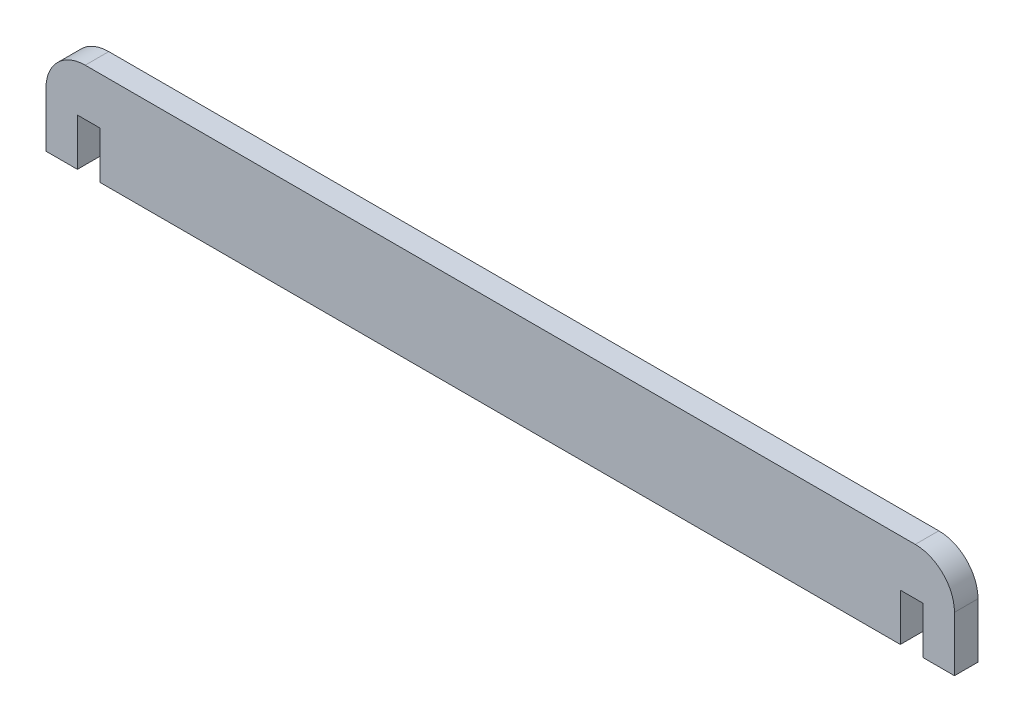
ISO-10303-21;
HEADER;
FILE_DESCRIPTION(('STEP AP214'),'2;1');
FILE_NAME('part.step','',(''),(''),'','','');
FILE_SCHEMA(('AUTOMOTIVE_DESIGN { 1 0 10303 214 1 1 1 1 }'));
ENDSEC;
DATA;
#1=APPLICATION_CONTEXT('core data for automotive mechanical design processes');
#2=APPLICATION_PROTOCOL_DEFINITION('international standard','automotive_design',2000,#1);
#3=PRODUCT_CONTEXT('',#1,'mechanical');
#4=PRODUCT('Part','Part','',(#3));
#5=PRODUCT_RELATED_PRODUCT_CATEGORY('part','',(#4));
#6=PRODUCT_DEFINITION_FORMATION('','',#4);
#7=PRODUCT_DEFINITION_CONTEXT('part definition',#1,'design');
#8=PRODUCT_DEFINITION('design','',#6,#7);
#9=PRODUCT_DEFINITION_SHAPE('','',#8);
#10=(LENGTH_UNIT() NAMED_UNIT(*) SI_UNIT(.MILLI.,.METRE.));
#11=(NAMED_UNIT(*) PLANE_ANGLE_UNIT() SI_UNIT($,.RADIAN.));
#12=(NAMED_UNIT(*) SI_UNIT($,.STERADIAN.) SOLID_ANGLE_UNIT());
#13=UNCERTAINTY_MEASURE_WITH_UNIT(LENGTH_MEASURE(1.E-05),#10,'distance_accuracy_value','');
#14=(GEOMETRIC_REPRESENTATION_CONTEXT(3) GLOBAL_UNCERTAINTY_ASSIGNED_CONTEXT((#13)) GLOBAL_UNIT_ASSIGNED_CONTEXT((#10,
#11,#12)) REPRESENTATION_CONTEXT('',''));
#15=CARTESIAN_POINT('',(0.,0.,0.));
#16=DIRECTION('',(0.,0.,1.));
#17=DIRECTION('',(1.,0.,0.));
#18=AXIS2_PLACEMENT_3D('',#15,#16,#17);
#19=CARTESIAN_POINT('',(0.,0.,3.));
#20=DIRECTION('',(1.,0.,0.));
#21=DIRECTION('',(0.,0.,-1.));
#22=AXIS2_PLACEMENT_3D('',#19,#20,#21);
#23=PLANE('',#22);
#24=DIRECTION('',(0.,-1.,0.));
#25=VECTOR('',#24,1.);
#26=CARTESIAN_POINT('',(0.,0.,0.));
#27=LINE('',#26,#25);
#28=CARTESIAN_POINT('',(0.,6.,0.));
#29=VERTEX_POINT('',#28);
#30=CARTESIAN_POINT('',(0.,0.,0.));
#31=VERTEX_POINT('',#30);
#32=EDGE_CURVE('E163',#29,#31,#27,.T.);
#33=ORIENTED_EDGE('',*,*,#32,.T.);
#34=DIRECTION('',(0.,0.,-1.));
#35=VECTOR('',#34,1.);
#36=CARTESIAN_POINT('',(0.,0.,3.));
#37=LINE('',#36,#35);
#38=CARTESIAN_POINT('',(0.,0.,3.));
#39=VERTEX_POINT('',#38);
#40=EDGE_CURVE('E145',#39,#31,#37,.T.);
#41=ORIENTED_EDGE('',*,*,#40,.F.);
#42=DIRECTION('',(0.,-1.,0.));
#43=VECTOR('',#42,1.);
#44=CARTESIAN_POINT('',(0.,0.,3.));
#45=LINE('',#44,#43);
#46=CARTESIAN_POINT('',(0.,6.,3.));
#47=VERTEX_POINT('',#46);
#48=EDGE_CURVE('E151',#47,#39,#45,.T.);
#49=ORIENTED_EDGE('',*,*,#48,.F.);
#50=DIRECTION('',(0.,0.,-1.));
#51=VECTOR('',#50,1.);
#52=CARTESIAN_POINT('',(0.,6.,3.));
#53=LINE('',#52,#51);
#54=EDGE_CURVE('E217',#47,#29,#53,.T.);
#55=ORIENTED_EDGE('',*,*,#54,.T.);
#56=EDGE_LOOP('',(#33,#41,#49,#55));
#57=FACE_BOUND('',#56,.T.);
#58=ADVANCED_FACE('F37',(#57),#23,.F.);
#59=CARTESIAN_POINT('',(0.,0.,3.));
#60=DIRECTION('',(0.,1.,0.));
#61=DIRECTION('',(0.,0.,1.));
#62=AXIS2_PLACEMENT_3D('',#59,#60,#61);
#63=PLANE('',#62);
#64=DIRECTION('',(1.,0.,0.));
#65=VECTOR('',#64,1.);
#66=CARTESIAN_POINT('',(0.,0.,0.));
#67=LINE('',#66,#65);
#68=CARTESIAN_POINT('',(102.,0.,0.));
#69=VERTEX_POINT('',#68);
#70=EDGE_CURVE('E248',#31,#69,#67,.T.);
#71=ORIENTED_EDGE('',*,*,#70,.T.);
#72=DIRECTION('',(0.,0.,-1.));
#73=VECTOR('',#72,1.);
#74=CARTESIAN_POINT('',(102.,0.,3.));
#75=LINE('',#74,#73);
#76=CARTESIAN_POINT('',(102.,0.,3.));
#77=VERTEX_POINT('',#76);
#78=EDGE_CURVE('E148',#77,#69,#75,.T.);
#79=ORIENTED_EDGE('',*,*,#78,.F.);
#80=DIRECTION('',(1.,0.,0.));
#81=VECTOR('',#80,1.);
#82=CARTESIAN_POINT('',(0.,0.,3.));
#83=LINE('',#82,#81);
#84=EDGE_CURVE('E141',#39,#77,#83,.T.);
#85=ORIENTED_EDGE('',*,*,#84,.F.);
#86=ORIENTED_EDGE('',*,*,#40,.T.);
#87=EDGE_LOOP('',(#71,#79,#85,#86));
#88=FACE_BOUND('',#87,.T.);
#89=ADVANCED_FACE('F143',(#88),#63,.F.);
#90=CARTESIAN_POINT('',(102.,0.,3.));
#91=DIRECTION('',(-1.,0.,0.));
#92=DIRECTION('',(0.,0.,1.));
#93=AXIS2_PLACEMENT_3D('',#90,#91,#92);
#94=PLANE('',#93);
#95=DIRECTION('',(0.,1.,0.));
#96=VECTOR('',#95,1.);
#97=CARTESIAN_POINT('',(102.,0.,0.));
#98=LINE('',#97,#96);
#99=CARTESIAN_POINT('',(102.,6.,0.));
#100=VERTEX_POINT('',#99);
#101=EDGE_CURVE('E246',#69,#100,#98,.T.);
#102=ORIENTED_EDGE('',*,*,#101,.T.);
#103=DIRECTION('',(0.,0.,-1.));
#104=VECTOR('',#103,1.);
#105=CARTESIAN_POINT('',(102.,6.,3.));
#106=LINE('',#105,#104);
#107=CARTESIAN_POINT('',(102.,6.,3.));
#108=VERTEX_POINT('',#107);
#109=EDGE_CURVE('E168',#108,#100,#106,.T.);
#110=ORIENTED_EDGE('',*,*,#109,.F.);
#111=DIRECTION('',(0.,1.,0.));
#112=VECTOR('',#111,1.);
#113=CARTESIAN_POINT('',(102.,0.,3.));
#114=LINE('',#113,#112);
#115=EDGE_CURVE('E150',#77,#108,#114,.T.);
#116=ORIENTED_EDGE('',*,*,#115,.F.);
#117=ORIENTED_EDGE('',*,*,#78,.T.);
#118=EDGE_LOOP('',(#102,#110,#116,#117));
#119=FACE_BOUND('',#118,.T.);
#120=ADVANCED_FACE('F265',(#119),#94,.F.);
#121=CARTESIAN_POINT('',(102.,6.,3.));
#122=DIRECTION('',(0.,1.,0.));
#123=DIRECTION('',(0.,0.,1.));
#124=AXIS2_PLACEMENT_3D('',#121,#122,#123);
#125=PLANE('',#124);
#126=DIRECTION('',(1.,0.,0.));
#127=VECTOR('',#126,1.);
#128=CARTESIAN_POINT('',(102.,6.,0.));
#129=LINE('',#128,#127);
#130=CARTESIAN_POINT('',(104.9,6.,0.));
#131=VERTEX_POINT('',#130);
#132=EDGE_CURVE('E241',#100,#131,#129,.T.);
#133=ORIENTED_EDGE('',*,*,#132,.T.);
#134=DIRECTION('',(0.,0.,-1.));
#135=VECTOR('',#134,1.);
#136=CARTESIAN_POINT('',(104.9,6.,3.));
#137=LINE('',#136,#135);
#138=CARTESIAN_POINT('',(104.9,6.,3.));
#139=VERTEX_POINT('',#138);
#140=EDGE_CURVE('E232',#139,#131,#137,.T.);
#141=ORIENTED_EDGE('',*,*,#140,.F.);
#142=DIRECTION('',(1.,0.,0.));
#143=VECTOR('',#142,1.);
#144=CARTESIAN_POINT('',(102.,6.,3.));
#145=LINE('',#144,#143);
#146=EDGE_CURVE('E242',#108,#139,#145,.T.);
#147=ORIENTED_EDGE('',*,*,#146,.F.);
#148=ORIENTED_EDGE('',*,*,#109,.T.);
#149=EDGE_LOOP('',(#133,#141,#147,#148));
#150=FACE_BOUND('',#149,.T.);
#151=ADVANCED_FACE('F239',(#150),#125,.F.);
#152=CARTESIAN_POINT('',(104.9,6.,3.));
#153=DIRECTION('',(1.,0.,0.));
#154=DIRECTION('',(0.,0.,-1.));
#155=AXIS2_PLACEMENT_3D('',#152,#153,#154);
#156=PLANE('',#155);
#157=DIRECTION('',(0.,-1.,0.));
#158=VECTOR('',#157,1.);
#159=CARTESIAN_POINT('',(104.9,6.,0.));
#160=LINE('',#159,#158);
#161=CARTESIAN_POINT('',(104.9,0.,0.));
#162=VERTEX_POINT('',#161);
#163=EDGE_CURVE('E207',#131,#162,#160,.T.);
#164=ORIENTED_EDGE('',*,*,#163,.T.);
#165=DIRECTION('',(0.,0.,-1.));
#166=VECTOR('',#165,1.);
#167=CARTESIAN_POINT('',(104.9,0.,3.));
#168=LINE('',#167,#166);
#169=CARTESIAN_POINT('',(104.9,0.,3.));
#170=VERTEX_POINT('',#169);
#171=EDGE_CURVE('E229',#170,#162,#168,.T.);
#172=ORIENTED_EDGE('',*,*,#171,.F.);
#173=DIRECTION('',(0.,-1.,0.));
#174=VECTOR('',#173,1.);
#175=CARTESIAN_POINT('',(104.9,6.,3.));
#176=LINE('',#175,#174);
#177=EDGE_CURVE('E262',#139,#170,#176,.T.);
#178=ORIENTED_EDGE('',*,*,#177,.F.);
#179=ORIENTED_EDGE('',*,*,#140,.T.);
#180=EDGE_LOOP('',(#164,#172,#178,#179));
#181=FACE_BOUND('',#180,.T.);
#182=ADVANCED_FACE('F272',(#181),#156,.F.);
#183=CARTESIAN_POINT('',(104.9,0.,3.));
#184=DIRECTION('',(0.,1.,0.));
#185=DIRECTION('',(0.,0.,1.));
#186=AXIS2_PLACEMENT_3D('',#183,#184,#185);
#187=PLANE('',#186);
#188=DIRECTION('',(1.,0.,0.));
#189=VECTOR('',#188,1.);
#190=CARTESIAN_POINT('',(104.9,0.,0.));
#191=LINE('',#190,#189);
#192=CARTESIAN_POINT('',(108.9,0.,0.));
#193=VERTEX_POINT('',#192);
#194=EDGE_CURVE('E203',#162,#193,#191,.T.);
#195=ORIENTED_EDGE('',*,*,#194,.T.);
#196=DIRECTION('',(0.,0.,-1.));
#197=VECTOR('',#196,1.);
#198=CARTESIAN_POINT('',(108.9,0.,3.));
#199=LINE('',#198,#197);
#200=CARTESIAN_POINT('',(108.9,0.,3.));
#201=VERTEX_POINT('',#200);
#202=EDGE_CURVE('E202',#201,#193,#199,.T.);
#203=ORIENTED_EDGE('',*,*,#202,.F.);
#204=DIRECTION('',(1.,0.,0.));
#205=VECTOR('',#204,1.);
#206=CARTESIAN_POINT('',(104.9,0.,3.));
#207=LINE('',#206,#205);
#208=EDGE_CURVE('E260',#170,#201,#207,.T.);
#209=ORIENTED_EDGE('',*,*,#208,.F.);
#210=ORIENTED_EDGE('',*,*,#171,.T.);
#211=EDGE_LOOP('',(#195,#203,#209,#210));
#212=FACE_BOUND('',#211,.T.);
#213=ADVANCED_FACE('F311',(#212),#187,.F.);
#214=CARTESIAN_POINT('',(108.9,0.,3.));
#215=DIRECTION('',(-1.,0.,0.));
#216=DIRECTION('',(0.,0.,1.));
#217=AXIS2_PLACEMENT_3D('',#214,#215,#216);
#218=PLANE('',#217);
#219=DIRECTION('',(0.,1.,0.));
#220=VECTOR('',#219,1.);
#221=CARTESIAN_POINT('',(108.9,0.,0.));
#222=LINE('',#221,#220);
#223=CARTESIAN_POINT('',(108.9,7.,0.));
#224=VERTEX_POINT('',#223);
#225=EDGE_CURVE('E197',#193,#224,#222,.T.);
#226=ORIENTED_EDGE('',*,*,#225,.T.);
#227=DIRECTION('',(0.,0.,-1.));
#228=VECTOR('',#227,1.);
#229=CARTESIAN_POINT('',(108.9,7.,3.));
#230=LINE('',#229,#228);
#231=CARTESIAN_POINT('',(108.9,7.,3.));
#232=VERTEX_POINT('',#231);
#233=EDGE_CURVE('E60',#224,#232,#230,.F.);
#234=ORIENTED_EDGE('',*,*,#233,.T.);
#235=DIRECTION('',(0.,1.,0.));
#236=VECTOR('',#235,1.);
#237=CARTESIAN_POINT('',(108.9,0.,3.));
#238=LINE('',#237,#236);
#239=EDGE_CURVE('E182',#201,#232,#238,.T.);
#240=ORIENTED_EDGE('',*,*,#239,.F.);
#241=ORIENTED_EDGE('',*,*,#202,.T.);
#242=EDGE_LOOP('',(#226,#234,#240,#241));
#243=FACE_BOUND('',#242,.T.);
#244=ADVANCED_FACE('F200',(#243),#218,.F.);
#245=CARTESIAN_POINT('',(-6.9,12.,3.));
#246=DIRECTION('',(0.,-1.,0.));
#247=DIRECTION('',(0.,0.,-1.));
#248=AXIS2_PLACEMENT_3D('',#245,#246,#247);
#249=PLANE('',#248);
#250=DIRECTION('',(-1.,0.,0.));
#251=VECTOR('',#250,1.);
#252=CARTESIAN_POINT('',(-6.9,12.,3.));
#253=LINE('',#252,#251);
#254=CARTESIAN_POINT('',(103.9,12.,3.));
#255=VERTEX_POINT('',#254);
#256=CARTESIAN_POINT('',(-1.9,12.,3.));
#257=VERTEX_POINT('',#256);
#258=EDGE_CURVE('E181',#255,#257,#253,.T.);
#259=ORIENTED_EDGE('',*,*,#258,.F.);
#260=DIRECTION('',(0.,0.,-1.));
#261=VECTOR('',#260,1.);
#262=CARTESIAN_POINT('',(103.9,12.,3.));
#263=LINE('',#262,#261);
#264=CARTESIAN_POINT('',(103.9,12.,0.));
#265=VERTEX_POINT('',#264);
#266=EDGE_CURVE('E166',#255,#265,#263,.T.);
#267=ORIENTED_EDGE('',*,*,#266,.T.);
#268=DIRECTION('',(-1.,0.,0.));
#269=VECTOR('',#268,1.);
#270=CARTESIAN_POINT('',(-6.9,12.,0.));
#271=LINE('',#270,#269);
#272=CARTESIAN_POINT('',(-1.9,12.,0.));
#273=VERTEX_POINT('',#272);
#274=EDGE_CURVE('E198',#265,#273,#271,.T.);
#275=ORIENTED_EDGE('',*,*,#274,.T.);
#276=DIRECTION('',(0.,0.,-1.));
#277=VECTOR('',#276,1.);
#278=CARTESIAN_POINT('',(-1.9,12.,3.));
#279=LINE('',#278,#277);
#280=EDGE_CURVE('E164',#273,#257,#279,.F.);
#281=ORIENTED_EDGE('',*,*,#280,.T.);
#282=EDGE_LOOP('',(#259,#267,#275,#281));
#283=FACE_BOUND('',#282,.T.);
#284=ADVANCED_FACE('F186',(#283),#249,.F.);
#285=CARTESIAN_POINT('',(-6.9,0.,3.));
#286=DIRECTION('',(1.,0.,0.));
#287=DIRECTION('',(0.,0.,-1.));
#288=AXIS2_PLACEMENT_3D('',#285,#286,#287);
#289=PLANE('',#288);
#290=DIRECTION('',(0.,-1.,0.));
#291=VECTOR('',#290,1.);
#292=CARTESIAN_POINT('',(-6.9,0.,3.));
#293=LINE('',#292,#291);
#294=CARTESIAN_POINT('',(-6.9,7.,3.));
#295=VERTEX_POINT('',#294);
#296=CARTESIAN_POINT('',(-6.9,0.,3.));
#297=VERTEX_POINT('',#296);
#298=EDGE_CURVE('E190',#295,#297,#293,.T.);
#299=ORIENTED_EDGE('',*,*,#298,.F.);
#300=DIRECTION('',(0.,0.,-1.));
#301=VECTOR('',#300,1.);
#302=CARTESIAN_POINT('',(-6.9,7.,3.));
#303=LINE('',#302,#301);
#304=CARTESIAN_POINT('',(-6.9,7.,0.));
#305=VERTEX_POINT('',#304);
#306=EDGE_CURVE('E11',#295,#305,#303,.T.);
#307=ORIENTED_EDGE('',*,*,#306,.T.);
#308=DIRECTION('',(0.,-1.,0.));
#309=VECTOR('',#308,1.);
#310=CARTESIAN_POINT('',(-6.9,0.,0.));
#311=LINE('',#310,#309);
#312=CARTESIAN_POINT('',(-6.9,0.,0.));
#313=VERTEX_POINT('',#312);
#314=EDGE_CURVE('E205',#305,#313,#311,.T.);
#315=ORIENTED_EDGE('',*,*,#314,.T.);
#316=DIRECTION('',(0.,0.,-1.));
#317=VECTOR('',#316,1.);
#318=CARTESIAN_POINT('',(-6.9,0.,3.));
#319=LINE('',#318,#317);
#320=EDGE_CURVE('E225',#297,#313,#319,.T.);
#321=ORIENTED_EDGE('',*,*,#320,.F.);
#322=EDGE_LOOP('',(#299,#307,#315,#321));
#323=FACE_BOUND('',#322,.T.);
#324=ADVANCED_FACE('F302',(#323),#289,.F.);
#325=CARTESIAN_POINT('',(-2.9,0.,3.));
#326=DIRECTION('',(0.,1.,0.));
#327=DIRECTION('',(-1.,0.,0.));
#328=AXIS2_PLACEMENT_3D('',#325,#326,#327);
#329=PLANE('',#328);
#330=DIRECTION('',(1.,0.,0.));
#331=VECTOR('',#330,1.);
#332=CARTESIAN_POINT('',(-2.9,0.,0.));
#333=LINE('',#332,#331);
#334=CARTESIAN_POINT('',(-2.9,0.,0.));
#335=VERTEX_POINT('',#334);
#336=EDGE_CURVE('E212',#313,#335,#333,.T.);
#337=ORIENTED_EDGE('',*,*,#336,.T.);
#338=DIRECTION('',(0.,0.,-1.));
#339=VECTOR('',#338,1.);
#340=CARTESIAN_POINT('',(-2.9,0.,3.));
#341=LINE('',#340,#339);
#342=CARTESIAN_POINT('',(-2.9,0.,3.));
#343=VERTEX_POINT('',#342);
#344=EDGE_CURVE('E222',#343,#335,#341,.T.);
#345=ORIENTED_EDGE('',*,*,#344,.F.);
#346=DIRECTION('',(1.,0.,0.));
#347=VECTOR('',#346,1.);
#348=CARTESIAN_POINT('',(-2.9,0.,3.));
#349=LINE('',#348,#347);
#350=EDGE_CURVE('E256',#297,#343,#349,.T.);
#351=ORIENTED_EDGE('',*,*,#350,.F.);
#352=ORIENTED_EDGE('',*,*,#320,.T.);
#353=EDGE_LOOP('',(#337,#345,#351,#352));
#354=FACE_BOUND('',#353,.T.);
#355=ADVANCED_FACE('F298',(#354),#329,.F.);
#356=CARTESIAN_POINT('',(-2.9,6.,3.));
#357=DIRECTION('',(-1.,0.,0.));
#358=DIRECTION('',(0.,0.,1.));
#359=AXIS2_PLACEMENT_3D('',#356,#357,#358);
#360=PLANE('',#359);
#361=DIRECTION('',(0.,1.,0.));
#362=VECTOR('',#361,1.);
#363=CARTESIAN_POINT('',(-2.9,6.,0.));
#364=LINE('',#363,#362);
#365=CARTESIAN_POINT('',(-2.9,6.,0.));
#366=VERTEX_POINT('',#365);
#367=EDGE_CURVE('E214',#335,#366,#364,.T.);
#368=ORIENTED_EDGE('',*,*,#367,.T.);
#369=DIRECTION('',(0.,0.,-1.));
#370=VECTOR('',#369,1.);
#371=CARTESIAN_POINT('',(-2.9,6.,3.));
#372=LINE('',#371,#370);
#373=CARTESIAN_POINT('',(-2.9,6.,3.));
#374=VERTEX_POINT('',#373);
#375=EDGE_CURVE('E219',#374,#366,#372,.T.);
#376=ORIENTED_EDGE('',*,*,#375,.F.);
#377=DIRECTION('',(0.,1.,0.));
#378=VECTOR('',#377,1.);
#379=CARTESIAN_POINT('',(-2.9,6.,3.));
#380=LINE('',#379,#378);
#381=EDGE_CURVE('E254',#343,#374,#380,.T.);
#382=ORIENTED_EDGE('',*,*,#381,.F.);
#383=ORIENTED_EDGE('',*,*,#344,.T.);
#384=EDGE_LOOP('',(#368,#376,#382,#383));
#385=FACE_BOUND('',#384,.T.);
#386=ADVANCED_FACE('F294',(#385),#360,.F.);
#387=CARTESIAN_POINT('',(0.,6.,3.));
#388=DIRECTION('',(0.,1.,0.));
#389=DIRECTION('',(0.,0.,1.));
#390=AXIS2_PLACEMENT_3D('',#387,#388,#389);
#391=PLANE('',#390);
#392=DIRECTION('',(1.,0.,0.));
#393=VECTOR('',#392,1.);
#394=CARTESIAN_POINT('',(0.,6.,0.));
#395=LINE('',#394,#393);
#396=EDGE_CURVE('E160',#366,#29,#395,.T.);
#397=ORIENTED_EDGE('',*,*,#396,.T.);
#398=ORIENTED_EDGE('',*,*,#54,.F.);
#399=DIRECTION('',(1.,0.,0.));
#400=VECTOR('',#399,1.);
#401=CARTESIAN_POINT('',(0.,6.,3.));
#402=LINE('',#401,#400);
#403=EDGE_CURVE('E156',#374,#47,#402,.T.);
#404=ORIENTED_EDGE('',*,*,#403,.F.);
#405=ORIENTED_EDGE('',*,*,#375,.T.);
#406=EDGE_LOOP('',(#397,#398,#404,#405));
#407=FACE_BOUND('',#406,.T.);
#408=ADVANCED_FACE('F289',(#407),#391,.F.);
#409=CARTESIAN_POINT('',(0.,0.,3.));
#410=DIRECTION('',(0.,0.,1.));
#411=DIRECTION('',(1.,0.,0.));
#412=AXIS2_PLACEMENT_3D('',#409,#410,#411);
#413=PLANE('',#412);
#414=ORIENTED_EDGE('',*,*,#239,.T.);
#415=CARTESIAN_POINT('',(103.9,7.,3.));
#416=DIRECTION('',(0.,0.,1.));
#417=DIRECTION('',(1.,0.,0.));
#418=AXIS2_PLACEMENT_3D('',#415,#416,#417);
#419=CIRCLE('',#418,5.);
#420=EDGE_CURVE('E45',#232,#255,#419,.T.);
#421=ORIENTED_EDGE('',*,*,#420,.T.);
#422=ORIENTED_EDGE('',*,*,#258,.T.);
#423=CARTESIAN_POINT('',(-1.9,7.,3.));
#424=DIRECTION('',(0.,0.,1.));
#425=DIRECTION('',(1.,0.,0.));
#426=AXIS2_PLACEMENT_3D('',#423,#424,#425);
#427=CIRCLE('',#426,5.);
#428=EDGE_CURVE('E52',#257,#295,#427,.T.);
#429=ORIENTED_EDGE('',*,*,#428,.T.);
#430=ORIENTED_EDGE('',*,*,#298,.T.);
#431=ORIENTED_EDGE('',*,*,#350,.T.);
#432=ORIENTED_EDGE('',*,*,#381,.T.);
#433=ORIENTED_EDGE('',*,*,#403,.T.);
#434=ORIENTED_EDGE('',*,*,#48,.T.);
#435=ORIENTED_EDGE('',*,*,#84,.T.);
#436=ORIENTED_EDGE('',*,*,#115,.T.);
#437=ORIENTED_EDGE('',*,*,#146,.T.);
#438=ORIENTED_EDGE('',*,*,#177,.T.);
#439=ORIENTED_EDGE('',*,*,#208,.T.);
#440=EDGE_LOOP('',(#414,#421,#422,#429,#430,#431,#432,#433,#434,#435,#436,#437,#438,#439));
#441=FACE_BOUND('',#440,.T.);
#442=ADVANCED_FACE('F154',(#441),#413,.T.);
#443=CARTESIAN_POINT('',(0.,0.,0.));
#444=DIRECTION('',(0.,0.,1.));
#445=DIRECTION('',(1.,0.,0.));
#446=AXIS2_PLACEMENT_3D('',#443,#444,#445);
#447=PLANE('',#446);
#448=ORIENTED_EDGE('',*,*,#274,.F.);
#449=CARTESIAN_POINT('',(103.9,7.,0.));
#450=DIRECTION('',(0.,0.,1.));
#451=DIRECTION('',(1.,0.,0.));
#452=AXIS2_PLACEMENT_3D('',#449,#450,#451);
#453=CIRCLE('',#452,5.);
#454=EDGE_CURVE('E176',#265,#224,#453,.F.);
#455=ORIENTED_EDGE('',*,*,#454,.T.);
#456=ORIENTED_EDGE('',*,*,#225,.F.);
#457=ORIENTED_EDGE('',*,*,#194,.F.);
#458=ORIENTED_EDGE('',*,*,#163,.F.);
#459=ORIENTED_EDGE('',*,*,#132,.F.);
#460=ORIENTED_EDGE('',*,*,#101,.F.);
#461=ORIENTED_EDGE('',*,*,#70,.F.);
#462=ORIENTED_EDGE('',*,*,#32,.F.);
#463=ORIENTED_EDGE('',*,*,#396,.F.);
#464=ORIENTED_EDGE('',*,*,#367,.F.);
#465=ORIENTED_EDGE('',*,*,#336,.F.);
#466=ORIENTED_EDGE('',*,*,#314,.F.);
#467=CARTESIAN_POINT('',(-1.9,7.,0.));
#468=DIRECTION('',(0.,0.,1.));
#469=DIRECTION('',(1.,0.,0.));
#470=AXIS2_PLACEMENT_3D('',#467,#468,#469);
#471=CIRCLE('',#470,5.);
#472=EDGE_CURVE('E174',#305,#273,#471,.F.);
#473=ORIENTED_EDGE('',*,*,#472,.T.);
#474=EDGE_LOOP('',(#448,#455,#456,#457,#458,#459,#460,#461,#462,#463,#464,#465,#466,#473));
#475=FACE_BOUND('',#474,.T.);
#476=ADVANCED_FACE('F195',(#475),#447,.F.);
#477=CARTESIAN_POINT('',(103.9,7.,3.));
#478=DIRECTION('',(0.,0.,-1.));
#479=DIRECTION('',(-1.,0.,0.));
#480=AXIS2_PLACEMENT_3D('',#477,#478,#479);
#481=CYLINDRICAL_SURFACE('',#480,5.);
#482=ORIENTED_EDGE('',*,*,#420,.F.);
#483=ORIENTED_EDGE('',*,*,#233,.F.);
#484=ORIENTED_EDGE('',*,*,#454,.F.);
#485=ORIENTED_EDGE('',*,*,#266,.F.);
#486=EDGE_LOOP('',(#482,#483,#484,#485));
#487=FACE_BOUND('',#486,.T.);
#488=ADVANCED_FACE('F192',(#487),#481,.T.);
#489=CARTESIAN_POINT('',(-1.9,7.,3.));
#490=DIRECTION('',(0.,0.,-1.));
#491=DIRECTION('',(-1.,0.,0.));
#492=AXIS2_PLACEMENT_3D('',#489,#490,#491);
#493=CYLINDRICAL_SURFACE('',#492,5.);
#494=ORIENTED_EDGE('',*,*,#428,.F.);
#495=ORIENTED_EDGE('',*,*,#280,.F.);
#496=ORIENTED_EDGE('',*,*,#472,.F.);
#497=ORIENTED_EDGE('',*,*,#306,.F.);
#498=EDGE_LOOP('',(#494,#495,#496,#497));
#499=FACE_BOUND('',#498,.T.);
#500=ADVANCED_FACE('F39',(#499),#493,.T.);
#501=CLOSED_SHELL('',(#58,#89,#120,#151,#182,#213,#244,#284,#324,#355,#386,#408,#442,#476,#488,#500));
#502=MANIFOLD_SOLID_BREP('B2',#501);
#503=ADVANCED_BREP_SHAPE_REPRESENTATION('',(#18,#502),#14);
#504=SHAPE_DEFINITION_REPRESENTATION(#9,#503);
ENDSEC;
END-ISO-10303-21;
